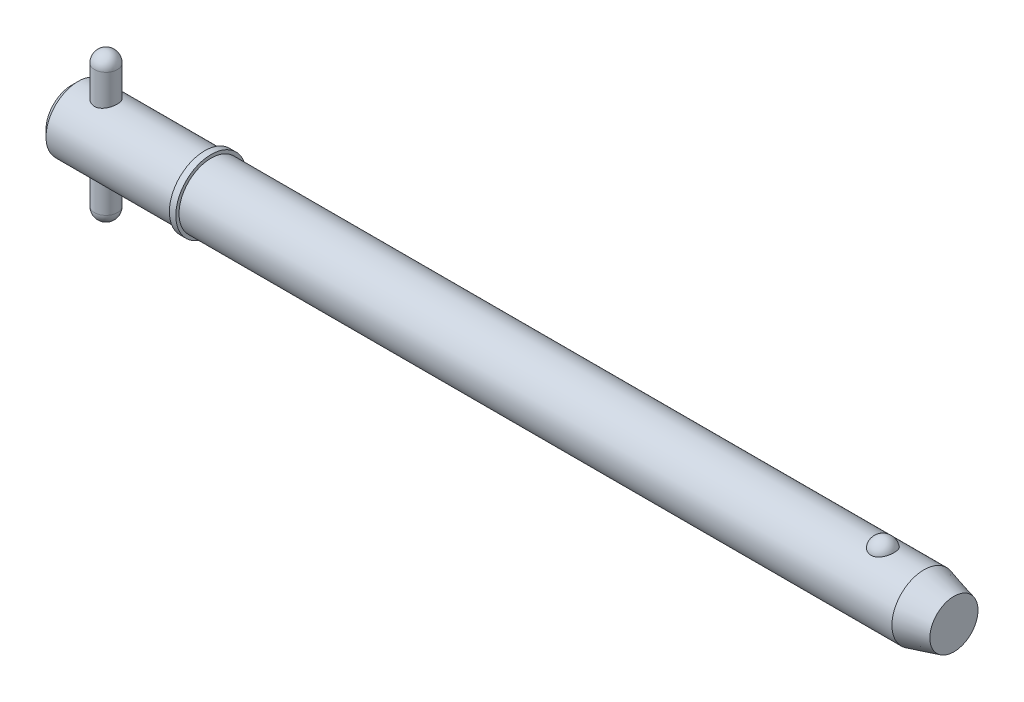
ISO-10303-21;
HEADER;
FILE_DESCRIPTION(('STEP AP214'),'2;1');
FILE_NAME('part.step','',(''),(''),'','','');
FILE_SCHEMA(('AUTOMOTIVE_DESIGN { 1 0 10303 214 1 1 1 1 }'));
ENDSEC;
DATA;
#1=APPLICATION_CONTEXT('core data for automotive mechanical design processes');
#2=APPLICATION_PROTOCOL_DEFINITION('international standard','automotive_design',2000,#1);
#3=PRODUCT_CONTEXT('',#1,'mechanical');
#4=PRODUCT('Part','Part','',(#3));
#5=PRODUCT_RELATED_PRODUCT_CATEGORY('part','',(#4));
#6=PRODUCT_DEFINITION_FORMATION('','',#4);
#7=PRODUCT_DEFINITION_CONTEXT('part definition',#1,'design');
#8=PRODUCT_DEFINITION('design','',#6,#7);
#9=PRODUCT_DEFINITION_SHAPE('','',#8);
#10=(LENGTH_UNIT() NAMED_UNIT(*) SI_UNIT(.MILLI.,.METRE.));
#11=(NAMED_UNIT(*) PLANE_ANGLE_UNIT() SI_UNIT($,.RADIAN.));
#12=(NAMED_UNIT(*) SI_UNIT($,.STERADIAN.) SOLID_ANGLE_UNIT());
#13=UNCERTAINTY_MEASURE_WITH_UNIT(LENGTH_MEASURE(1.E-05),#10,'distance_accuracy_value','');
#14=(GEOMETRIC_REPRESENTATION_CONTEXT(3) GLOBAL_UNCERTAINTY_ASSIGNED_CONTEXT((#13)) GLOBAL_UNIT_ASSIGNED_CONTEXT((#10,
#11,#12)) REPRESENTATION_CONTEXT('',''));
#15=CARTESIAN_POINT('',(0.,0.,0.));
#16=DIRECTION('',(0.,0.,1.));
#17=DIRECTION('',(1.,0.,0.));
#18=AXIS2_PLACEMENT_3D('',#15,#16,#17);
#19=CARTESIAN_POINT('',(5.94,12.7,0.));
#20=DIRECTION('',(0.,-1.,0.));
#21=DIRECTION('',(0.,0.,-1.));
#22=AXIS2_PLACEMENT_3D('',#19,#20,#21);
#23=CYLINDRICAL_SURFACE('',#22,1.98);
#24=CARTESIAN_POINT('',(5.94,-10.72,0.));
#25=DIRECTION('',(0.,-1.,0.));
#26=DIRECTION('',(0.,0.,-1.));
#27=AXIS2_PLACEMENT_3D('',#24,#25,#26);
#28=CIRCLE('',#27,1.98);
#29=CARTESIAN_POINT('',(5.94,-10.72,-1.98));
#30=VERTEX_POINT('',#29);
#31=EDGE_CURVE('P0_E10',#30,#30,#28,.F.);
#32=ORIENTED_EDGE('',*,*,#31,.T.);
#33=EDGE_LOOP('',(#32));
#34=FACE_BOUND('',#33,.T.);
#35=CARTESIAN_POINT('',(5.94,10.72,0.));
#36=DIRECTION('',(0.,-1.,0.));
#37=DIRECTION('',(0.,0.,-1.));
#38=AXIS2_PLACEMENT_3D('',#35,#36,#37);
#39=CIRCLE('',#38,1.98);
#40=CARTESIAN_POINT('',(5.94,10.72,-1.98));
#41=VERTEX_POINT('',#40);
#42=EDGE_CURVE('P0_E21',#41,#41,#39,.T.);
#43=ORIENTED_EDGE('',*,*,#42,.T.);
#44=EDGE_LOOP('',(#43));
#45=FACE_BOUND('',#44,.T.);
#46=ADVANCED_FACE('P0_F14',(#34,#45),#23,.T.);
#47=CARTESIAN_POINT('',(5.94,-10.72,0.));
#48=DIRECTION('',(0.,0.,1.));
#49=DIRECTION('',(1.,0.,0.));
#50=AXIS2_PLACEMENT_3D('',#47,#48,#49);
#51=SPHERICAL_SURFACE('',#50,1.98);
#52=CARTESIAN_POINT('',(5.94,-10.72,0.));
#53=DIRECTION('',(0.,-1.,0.));
#54=DIRECTION('',(0.,0.,-1.));
#55=AXIS2_PLACEMENT_3D('',#52,#53,#54);
#56=SPHERICAL_SURFACE('',#55,1.98);
#57=ORIENTED_EDGE('',*,*,#31,.F.);
#58=EDGE_LOOP('',(#57));
#59=FACE_BOUND('',#58,.T.);
#60=ADVANCED_FACE('P0_F29',(#59),#56,.T.);
#61=CARTESIAN_POINT('',(5.94,10.72,0.));
#62=DIRECTION('',(0.,0.,1.));
#63=DIRECTION('',(1.,0.,0.));
#64=AXIS2_PLACEMENT_3D('',#61,#62,#63);
#65=SPHERICAL_SURFACE('',#64,1.98);
#66=CARTESIAN_POINT('',(5.94,10.72,0.));
#67=DIRECTION('',(0.,-1.,0.));
#68=DIRECTION('',(0.,0.,-1.));
#69=AXIS2_PLACEMENT_3D('',#66,#67,#68);
#70=SPHERICAL_SURFACE('',#69,1.98);
#71=ORIENTED_EDGE('',*,*,#42,.F.);
#72=EDGE_LOOP('',(#71));
#73=FACE_BOUND('',#72,.T.);
#74=ADVANCED_FACE('P0_F16',(#73),#70,.T.);
#75=CLOSED_SHELL('',(#46,#60,#74));
#76=MANIFOLD_SOLID_BREP('P0_B1',#75);
#77=CARTESIAN_POINT('',(0.,0.,0.));
#78=DIRECTION('',(1.,0.,0.));
#79=DIRECTION('',(0.,0.,-1.));
#80=AXIS2_PLACEMENT_3D('',#77,#78,#79);
#81=CYLINDRICAL_SURFACE('',#80,5.555);
#82=CARTESIAN_POINT('',(147.517114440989,0.,0.));
#83=DIRECTION('',(1.,0.,0.));
#84=DIRECTION('',(0.,0.,-1.));
#85=AXIS2_PLACEMENT_3D('',#82,#83,#84);
#86=CIRCLE('',#85,5.555);
#87=CARTESIAN_POINT('',(147.517114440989,0.,-5.555));
#88=VERTEX_POINT('',#87);
#89=EDGE_CURVE('P1_E81',#88,#88,#86,.T.);
#90=ORIENTED_EDGE('',*,*,#89,.F.);
#91=EDGE_LOOP('',(#90));
#92=FACE_BOUND('',#91,.T.);
#93=CARTESIAN_POINT('',(24.13,0.,0.));
#94=DIRECTION('',(1.,0.,0.));
#95=DIRECTION('',(0.,0.,-1.));
#96=AXIS2_PLACEMENT_3D('',#93,#94,#95);
#97=CIRCLE('',#96,5.555);
#98=CARTESIAN_POINT('',(24.13,0.,-5.555));
#99=VERTEX_POINT('',#98);
#100=EDGE_CURVE('P1_E85',#99,#99,#97,.T.);
#101=ORIENTED_EDGE('',*,*,#100,.T.);
#102=EDGE_LOOP('',(#101));
#103=FACE_BOUND('',#102,.T.);
#104=CARTESIAN_POINT('',(140.398626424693,5.16741224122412,2.03859650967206));
#105=CARTESIAN_POINT('',(140.292949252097,5.16740893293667,2.03859990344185));
#106=CARTESIAN_POINT('',(140.18729894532,5.17079470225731,2.03008306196));
#107=CARTESIAN_POINT('',(139.979141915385,5.18392795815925,1.99630721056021));
#108=CARTESIAN_POINT('',(139.876634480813,5.19367399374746,1.97105201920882));
#109=CARTESIAN_POINT('',(139.677771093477,5.21839168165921,1.9046399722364));
#110=CARTESIAN_POINT('',(139.581406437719,5.23335573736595,1.8635062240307));
#111=CARTESIAN_POINT('',(139.397080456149,5.26688076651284,1.76652592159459));
#112=CARTESIAN_POINT('',(139.309120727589,5.28544242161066,1.71067657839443));
#113=CARTESIAN_POINT('',(139.141265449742,5.32479845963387,1.58399959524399));
#114=CARTESIAN_POINT('',(139.06166564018,5.34564089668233,1.51279545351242));
#115=CARTESIAN_POINT('',(138.91512901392,5.38697258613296,1.35828584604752));
#116=CARTESIAN_POINT('',(138.848194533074,5.40746177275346,1.27497815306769));
#117=CARTESIAN_POINT('',(138.72561039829,5.44694508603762,1.0944029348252));
#118=CARTESIAN_POINT('',(138.670598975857,5.46583143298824,0.996677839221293));
#119=CARTESIAN_POINT('',(138.576937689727,5.49908030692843,0.792961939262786));
#120=CARTESIAN_POINT('',(138.538289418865,5.513442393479,0.686970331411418));
#121=CARTESIAN_POINT('',(138.477680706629,5.53635851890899,0.468019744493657));
#122=CARTESIAN_POINT('',(138.455972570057,5.54482455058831,0.354981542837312));
#123=CARTESIAN_POINT('',(138.430636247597,5.55473324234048,0.12659586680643));
#124=CARTESIAN_POINT('',(138.427007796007,5.55617600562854,0.0112484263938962));
#125=CARTESIAN_POINT('',(138.437881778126,5.55189984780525,-0.218011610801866));
#126=CARTESIAN_POINT('',(138.452315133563,5.54620821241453,-0.331928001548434));
#127=CARTESIAN_POINT('',(138.498903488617,5.52828920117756,-0.555544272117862));
#128=CARTESIAN_POINT('',(138.531058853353,5.5160616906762,-0.665244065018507));
#129=CARTESIAN_POINT('',(138.612488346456,5.48630779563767,-0.877469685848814));
#130=CARTESIAN_POINT('',(138.661781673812,5.4687754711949,-0.979987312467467));
#131=CARTESIAN_POINT('',(138.776478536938,5.43024700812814,-1.17486975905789));
#132=CARTESIAN_POINT('',(138.841883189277,5.4092506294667,-1.26723387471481));
#133=CARTESIAN_POINT('',(138.987571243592,5.36600927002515,-1.4394013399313));
#134=CARTESIAN_POINT('',(139.067885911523,5.34376173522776,-1.51917763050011));
#135=CARTESIAN_POINT('',(139.241452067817,5.30057971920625,-1.66360338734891));
#136=CARTESIAN_POINT('',(139.334702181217,5.27964509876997,-1.72825445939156));
#137=CARTESIAN_POINT('',(139.529393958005,5.24205250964,-1.83909478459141));
#138=CARTESIAN_POINT('',(139.630590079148,5.22530519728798,-1.88568407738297));
#139=CARTESIAN_POINT('',(139.840155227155,5.1975091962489,-1.96100802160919));
#140=CARTESIAN_POINT('',(139.948521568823,5.1864583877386,-1.98974931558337));
#141=CARTESIAN_POINT('',(140.163498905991,5.17184410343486,-2.02742262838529));
#142=CARTESIAN_POINT('',(140.269925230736,5.1679328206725,-2.03727608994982));
#143=CARTESIAN_POINT('',(140.482992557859,5.16698995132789,-2.03966777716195));
#144=CARTESIAN_POINT('',(140.589633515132,5.16995704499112,-2.0322093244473));
#145=CARTESIAN_POINT('',(140.796773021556,5.18222383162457,-2.00071170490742));
#146=CARTESIAN_POINT('',(140.897359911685,5.19133213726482,-1.97717337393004));
#147=CARTESIAN_POINT('',(141.093014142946,5.21467637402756,-1.91475248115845));
#148=CARTESIAN_POINT('',(141.188081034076,5.22891272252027,-1.87586867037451));
#149=CARTESIAN_POINT('',(141.372371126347,5.26137066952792,-1.78282713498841));
#150=CARTESIAN_POINT('',(141.461419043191,5.27967329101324,-1.72835124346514));
#151=CARTESIAN_POINT('',(141.629288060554,5.3181741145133,-1.60597483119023));
#152=CARTESIAN_POINT('',(141.708106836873,5.33837274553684,-1.5380712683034));
#153=CARTESIAN_POINT('',(141.857515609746,5.37968287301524,-1.38688970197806));
#154=CARTESIAN_POINT('',(141.927505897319,5.40079011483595,-1.30301744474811));
#155=CARTESIAN_POINT('',(142.053012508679,5.44074401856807,-1.12458170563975));
#156=CARTESIAN_POINT('',(142.108526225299,5.45959027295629,-1.03001630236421));
#157=CARTESIAN_POINT('',(142.205550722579,5.49369849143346,-0.829439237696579));
#158=CARTESIAN_POINT('',(142.246548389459,5.50882422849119,-0.723155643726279));
#159=CARTESIAN_POINT('',(142.311125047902,5.53310911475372,-0.504772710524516));
#160=CARTESIAN_POINT('',(142.334703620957,5.54226812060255,-0.392673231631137));
#161=CARTESIAN_POINT('',(142.364013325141,5.55370358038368,-0.165459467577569));
#162=CARTESIAN_POINT('',(142.369688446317,5.55595843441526,-0.0503368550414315));
#163=CARTESIAN_POINT('',(142.362916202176,5.55329317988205,0.179288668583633));
#164=CARTESIAN_POINT('',(142.350469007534,5.54837313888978,0.293791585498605));
#165=CARTESIAN_POINT('',(142.307779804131,5.53189037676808,0.51852641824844));
#166=CARTESIAN_POINT('',(142.277598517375,5.5203503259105,0.62877154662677));
#167=CARTESIAN_POINT('',(142.200096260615,5.49182453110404,0.842318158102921));
#168=CARTESIAN_POINT('',(142.152774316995,5.47483847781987,0.94561924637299));
#169=CARTESIAN_POINT('',(142.041720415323,5.43710633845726,1.14281571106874));
#170=CARTESIAN_POINT('',(141.977921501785,5.41634501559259,1.23667048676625));
#171=CARTESIAN_POINT('',(141.835357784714,5.37334572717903,1.4118524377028));
#172=CARTESIAN_POINT('',(141.75659323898,5.35110778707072,1.49317982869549));
#173=CARTESIAN_POINT('',(141.586423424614,5.30779474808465,1.64049162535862));
#174=CARTESIAN_POINT('',(141.49510026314,5.2867132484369,1.70656877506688));
#175=CARTESIAN_POINT('',(141.301739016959,5.2480485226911,1.82201372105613));
#176=CARTESIAN_POINT('',(141.199700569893,5.23046541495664,1.87138095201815));
#177=CARTESIAN_POINT('',(140.983618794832,5.20042692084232,1.95335298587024));
#178=CARTESIAN_POINT('',(140.869260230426,5.18820192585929,1.98521734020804));
#179=CARTESIAN_POINT('',(140.636130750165,5.17169804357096,2.02783294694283));
#180=CARTESIAN_POINT('',(140.517361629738,5.16741595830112,2.03859269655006));
#181=CARTESIAN_POINT('',(140.398626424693,5.16741224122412,2.03859650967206));
#182=B_SPLINE_CURVE_WITH_KNOTS('',3,(#104,#105,#106,#107,#108,#109,#110,#111,#112,#113,#114,
#115,#116,#117,#118,#119,#120,#121,#122,#123,#124,#125,#126,#127,#128,#129,#130,#131,#132,#133,
#134,#135,#136,#137,#138,#139,#140,#141,#142,#143,#144,#145,#146,#147,#148,#149,#150,#151,#152,
#153,#154,#155,#156,#157,#158,#159,#160,#161,#162,#163,#164,#165,#166,#167,#168,#169,#170,#171,
#172,#173,#174,#175,#176,#177,#178,#179,#180,#181),.UNSPECIFIED.,.T.,.F.,(4,2,2,2,2,2,2,2,2,2,2,
2,2,2,2,2,2,2,2,2,2,2,2,2,2,2,2,2,2,2,2,2,2,2,2,2,2,2,4),(0.,0.316595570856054,
0.633118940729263,0.94918341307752,1.26530783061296,1.59030762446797,1.91536729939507,
2.25495824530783,2.59458224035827,2.93917283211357,3.28375835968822,3.62703002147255,
3.97030875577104,4.31397329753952,4.657661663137,5.00207904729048,5.34645984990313,
5.68270547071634,6.01882587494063,6.33808403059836,6.65728093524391,6.9669637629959,
7.27667180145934,7.59321535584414,7.90983070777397,8.24210387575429,8.57443684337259,
8.91755896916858,9.26068933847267,9.60489211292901,9.94909164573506,10.2921194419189,
10.6351667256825,10.9796305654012,11.3240884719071,11.6663928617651,12.0087088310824,
12.3645679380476,12.7202837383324),.UNSPECIFIED.);
#183=CARTESIAN_POINT('',(140.398626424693,5.16741224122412,2.03859650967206));
#184=VERTEX_POINT('',#183);
#185=EDGE_CURVE('P1_E35',#184,#184,#182,.T.);
#186=ORIENTED_EDGE('',*,*,#185,.T.);
#187=EDGE_LOOP('',(#186));
#188=FACE_BOUND('',#187,.T.);
#189=ADVANCED_FACE('P1_F13',(#92,#103,#188),#81,.T.);
#190=CARTESIAN_POINT('',(0.,0.,0.));
#191=DIRECTION('',(-1.,0.,0.));
#192=DIRECTION('',(0.,0.,1.));
#193=AXIS2_PLACEMENT_3D('',#190,#191,#192);
#194=PLANE('',#193);
#195=CARTESIAN_POINT('',(0.,0.,0.));
#196=DIRECTION('',(1.,0.,0.));
#197=DIRECTION('',(0.,0.,-1.));
#198=AXIS2_PLACEMENT_3D('',#195,#196,#197);
#199=CIRCLE('',#198,4.444);
#200=CARTESIAN_POINT('',(0.,0.,-4.444));
#201=VERTEX_POINT('',#200);
#202=EDGE_CURVE('P1_E9',#201,#201,#199,.T.);
#203=ORIENTED_EDGE('',*,*,#202,.F.);
#204=EDGE_LOOP('',(#203));
#205=FACE_BOUND('',#204,.T.);
#206=ADVANCED_FACE('P1_F15',(#205),#194,.T.);
#207=CARTESIAN_POINT('',(1.111,0.,0.));
#208=DIRECTION('',(1.,0.,0.));
#209=DIRECTION('',(0.,0.,-1.));
#210=AXIS2_PLACEMENT_3D('',#207,#208,#209);
#211=CONICAL_SURFACE('',#210,5.555,0.78539816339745);
#212=ORIENTED_EDGE('',*,*,#202,.T.);
#213=EDGE_LOOP('',(#212));
#214=FACE_BOUND('',#213,.T.);
#215=CARTESIAN_POINT('',(1.111,0.,0.));
#216=DIRECTION('',(1.,0.,0.));
#217=DIRECTION('',(0.,0.,-1.));
#218=AXIS2_PLACEMENT_3D('',#215,#216,#217);
#219=CIRCLE('',#218,5.555);
#220=CARTESIAN_POINT('',(1.111,0.,-5.555));
#221=VERTEX_POINT('',#220);
#222=EDGE_CURVE('P1_E26',#221,#221,#219,.T.);
#223=ORIENTED_EDGE('',*,*,#222,.F.);
#224=EDGE_LOOP('',(#223));
#225=FACE_BOUND('',#224,.T.);
#226=ADVANCED_FACE('P1_F77',(#214,#225),#211,.T.);
#227=CARTESIAN_POINT('',(0.,0.,0.));
#228=DIRECTION('',(1.,0.,0.));
#229=DIRECTION('',(0.,0.,-1.));
#230=AXIS2_PLACEMENT_3D('',#227,#228,#229);
#231=CYLINDRICAL_SURFACE('',#230,5.555);
#232=CARTESIAN_POINT('',(5.94,-5.19014691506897,1.98));
#233=CARTESIAN_POINT('',(5.83264687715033,-5.19014494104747,1.98000226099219));
#234=CARTESIAN_POINT('',(5.7253094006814,-5.19351395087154,1.97123988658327));
#235=CARTESIAN_POINT('',(5.51384517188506,-5.20654291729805,1.93656219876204));
#236=CARTESIAN_POINT('',(5.40971858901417,-5.21620320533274,1.91064598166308));
#237=CARTESIAN_POINT('',(5.20778082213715,-5.24058443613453,1.84271148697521));
#238=CARTESIAN_POINT('',(5.10995634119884,-5.25529427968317,1.80072850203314));
#239=CARTESIAN_POINT('',(4.92270352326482,-5.28810012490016,1.70197537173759));
#240=CARTESIAN_POINT('',(4.83327743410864,-5.3061970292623,1.64520128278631));
#241=CARTESIAN_POINT('',(4.66135184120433,-5.34464714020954,1.51575187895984));
#242=CARTESIAN_POINT('',(4.57928277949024,-5.36506222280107,1.44252311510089));
#243=CARTESIAN_POINT('',(4.42829115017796,-5.40532920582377,1.28342047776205));
#244=CARTESIAN_POINT('',(4.35937105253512,-5.42518099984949,1.19754423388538));
#245=CARTESIAN_POINT('',(4.23461605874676,-5.46281133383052,1.01237205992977));
#246=CARTESIAN_POINT('',(4.17924129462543,-5.48050875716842,0.912748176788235));
#247=CARTESIAN_POINT('',(4.0862117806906,-5.51109938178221,0.70485824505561));
#248=CARTESIAN_POINT('',(4.0485515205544,-5.52399407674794,0.596594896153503));
#249=CARTESIAN_POINT('',(3.99350662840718,-5.54308759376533,0.379019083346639));
#250=CARTESIAN_POINT('',(3.97538263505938,-5.54952987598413,0.269915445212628));
#251=CARTESIAN_POINT('',(3.95756405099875,-5.55586205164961,0.0500378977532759));
#252=CARTESIAN_POINT('',(3.95786404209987,-5.55575387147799,-0.060735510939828));
#253=CARTESIAN_POINT('',(3.97643665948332,-5.54915684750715,-0.275539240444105));
#254=CARTESIAN_POINT('',(3.99390415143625,-5.54295384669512,-0.379649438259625));
#255=CARTESIAN_POINT('',(4.0449721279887,-5.52523170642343,-0.583350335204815));
#256=CARTESIAN_POINT('',(4.07857373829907,-5.51371219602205,-0.682940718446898));
#257=CARTESIAN_POINT('',(4.16137312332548,-5.4863099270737,-0.876423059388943));
#258=CARTESIAN_POINT('',(4.2107826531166,-5.47036834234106,-0.970215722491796));
#259=CARTESIAN_POINT('',(4.32361427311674,-5.43575653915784,-1.1484017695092));
#260=CARTESIAN_POINT('',(4.38704062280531,-5.41708549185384,-1.23279228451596));
#261=CARTESIAN_POINT('',(4.53006791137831,-5.37778429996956,-1.39454579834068));
#262=CARTESIAN_POINT('',(4.61035105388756,-5.35710277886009,-1.4712940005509));
#263=CARTESIAN_POINT('',(4.78279835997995,-5.31692766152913,-1.6104545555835));
#264=CARTESIAN_POINT('',(4.874964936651,-5.29743430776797,-1.67286398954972));
#265=CARTESIAN_POINT('',(5.07076688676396,-5.26153775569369,-1.78259698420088));
#266=CARTESIAN_POINT('',(5.17458163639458,-5.24519780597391,-1.8296227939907));
#267=CARTESIAN_POINT('',(5.38938990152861,-5.21818744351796,-1.90530278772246));
#268=CARTESIAN_POINT('',(5.50037985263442,-5.20751423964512,-1.93396601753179));
#269=CARTESIAN_POINT('',(5.72036376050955,-5.19369176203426,-1.97077654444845));
#270=CARTESIAN_POINT('',(5.82917370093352,-5.19018851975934,-1.97989015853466));
#271=CARTESIAN_POINT('',(6.04680100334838,-5.19010609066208,-1.98010779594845));
#272=CARTESIAN_POINT('',(6.15561835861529,-5.19352540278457,-1.97121572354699));
#273=CARTESIAN_POINT('',(6.36548036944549,-5.20654623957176,-1.93654727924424));
#274=CARTESIAN_POINT('',(6.46666051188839,-5.21588705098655,-1.91148218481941));
#275=CARTESIAN_POINT('',(6.66334537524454,-5.23939939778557,-1.84605494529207));
#276=CARTESIAN_POINT('',(6.75884899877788,-5.25357186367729,-1.8056898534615));
#277=CARTESIAN_POINT('',(6.94517989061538,-5.28576258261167,-1.70921153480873));
#278=CARTESIAN_POINT('',(7.03572661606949,-5.30389804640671,-1.65259670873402));
#279=CARTESIAN_POINT('',(7.20638087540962,-5.34176077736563,-1.52577523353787));
#280=CARTESIAN_POINT('',(7.28648490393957,-5.36148857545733,-1.45556404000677));
#281=CARTESIAN_POINT('',(7.43864697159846,-5.40165494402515,-1.2988614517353));
#282=CARTESIAN_POINT('',(7.50999887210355,-5.42207106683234,-1.21167640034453));
#283=CARTESIAN_POINT('',(7.63712639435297,-5.46023601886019,-1.026066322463));
#284=CARTESIAN_POINT('',(7.69290228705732,-5.47798489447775,-0.927641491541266));
#285=CARTESIAN_POINT('',(7.78684673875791,-5.50876590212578,-0.722633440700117));
#286=CARTESIAN_POINT('',(7.82510508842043,-5.52182201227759,-0.616095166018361));
#287=CARTESIAN_POINT('',(7.88297051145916,-5.54184206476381,-0.397530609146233));
#288=CARTESIAN_POINT('',(7.90258540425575,-5.5488085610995,-0.285506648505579));
#289=CARTESIAN_POINT('',(7.9218262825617,-5.55564472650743,-0.065566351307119));
#290=CARTESIAN_POINT('',(7.92245987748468,-5.55587212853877,0.0422515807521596));
#291=CARTESIAN_POINT('',(7.90626329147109,-5.55011340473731,0.256387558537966));
#292=CARTESIAN_POINT('',(7.88943488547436,-5.54412791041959,0.362705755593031));
#293=CARTESIAN_POINT('',(7.83948457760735,-5.52676548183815,0.568649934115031));
#294=CARTESIAN_POINT('',(7.8067003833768,-5.51550046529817,0.668367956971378));
#295=CARTESIAN_POINT('',(7.72609369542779,-5.48874437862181,0.860911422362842));
#296=CARTESIAN_POINT('',(7.67826838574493,-5.47325251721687,0.953735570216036));
#297=CARTESIAN_POINT('',(7.56675024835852,-5.43884382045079,1.13391068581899));
#298=CARTESIAN_POINT('',(7.50249968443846,-5.41981485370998,1.22089468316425));
#299=CARTESIAN_POINT('',(7.36086495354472,-5.38069275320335,1.38316665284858));
#300=CARTESIAN_POINT('',(7.28347630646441,-5.36059925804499,1.45845061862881));
#301=CARTESIAN_POINT('',(7.11347587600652,-5.32048380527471,1.59876646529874));
#302=CARTESIAN_POINT('',(7.02032386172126,-5.30050854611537,1.66315951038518));
#303=CARTESIAN_POINT('',(6.82388804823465,-5.26398994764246,1.77536801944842));
#304=CARTESIAN_POINT('',(6.7206049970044,-5.24744635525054,1.82318470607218));
#305=CARTESIAN_POINT('',(6.50639706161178,-5.21987969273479,1.90068230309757));
#306=CARTESIAN_POINT('',(6.3954529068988,-5.20887116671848,1.93031547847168));
#307=CARTESIAN_POINT('',(6.16966522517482,-5.19400760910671,1.96996824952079));
#308=CARTESIAN_POINT('',(6.05482366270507,-5.19014902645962,1.97999758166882));
#309=CARTESIAN_POINT('',(5.94,-5.19014691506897,1.98));
#310=B_SPLINE_CURVE_WITH_KNOTS('',3,(#232,#233,#234,#235,#236,#237,#238,#239,#240,#241,#242,
#243,#244,#245,#246,#247,#248,#249,#250,#251,#252,#253,#254,#255,#256,#257,#258,#259,#260,#261,
#262,#263,#264,#265,#266,#267,#268,#269,#270,#271,#272,#273,#274,#275,#276,#277,#278,#279,#280,
#281,#282,#283,#284,#285,#286,#287,#288,#289,#290,#291,#292,#293,#294,#295,#296,#297,#298,#299,
#300,#301,#302,#303,#304,#305,#306,#307,#308,#309),.UNSPECIFIED.,.T.,.F.,(4,2,2,2,2,2,2,2,2,2,2,
2,2,2,2,2,2,2,2,2,2,2,2,2,2,2,2,2,2,2,2,2,2,2,2,2,2,2,4),(0.,0.321632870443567,
0.643282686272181,0.964229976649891,1.28526292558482,1.61937087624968,1.9535415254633,
2.29784481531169,2.64204093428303,2.97269632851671,3.30325448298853,3.61901541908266,
3.93479838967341,4.25500220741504,4.57530346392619,4.91268648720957,5.25013812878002,
5.59378026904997,5.93725299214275,6.26331481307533,6.58930593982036,6.90185604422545,
7.21446637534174,7.53801472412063,7.86167140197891,8.20353561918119,8.54539388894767,
8.88547970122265,9.22542281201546,9.54728637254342,9.86911722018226,10.1844146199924,
10.4997710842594,10.827730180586,11.1558013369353,11.499115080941,11.8424034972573,
12.1865892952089,12.5306041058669),.UNSPECIFIED.);
#311=CARTESIAN_POINT('',(5.94,-5.19014691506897,1.98));
#312=VERTEX_POINT('',#311);
#313=EDGE_CURVE('P1_E17',#312,#312,#310,.T.);
#314=ORIENTED_EDGE('',*,*,#313,.F.);
#315=EDGE_LOOP('',(#314));
#316=FACE_BOUND('',#315,.T.);
#317=CARTESIAN_POINT('',(5.94,5.19014691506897,1.98));
#318=CARTESIAN_POINT('',(6.04735312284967,5.19014494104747,1.98000226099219));
#319=CARTESIAN_POINT('',(6.1546905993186,5.19351395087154,1.97123988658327));
#320=CARTESIAN_POINT('',(6.36615482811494,5.20654291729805,1.93656219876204));
#321=CARTESIAN_POINT('',(6.47028141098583,5.21620320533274,1.91064598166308));
#322=CARTESIAN_POINT('',(6.67221917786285,5.24058443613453,1.84271148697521));
#323=CARTESIAN_POINT('',(6.77004365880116,5.25529427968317,1.80072850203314));
#324=CARTESIAN_POINT('',(6.95729647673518,5.28810012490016,1.70197537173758));
#325=CARTESIAN_POINT('',(7.04672256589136,5.3061970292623,1.64520128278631));
#326=CARTESIAN_POINT('',(7.21864815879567,5.34464714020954,1.51575187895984));
#327=CARTESIAN_POINT('',(7.30071722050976,5.36506222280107,1.44252311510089));
#328=CARTESIAN_POINT('',(7.45170884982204,5.40532920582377,1.28342047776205));
#329=CARTESIAN_POINT('',(7.52062894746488,5.42518099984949,1.19754423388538));
#330=CARTESIAN_POINT('',(7.64538394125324,5.46281133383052,1.01237205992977));
#331=CARTESIAN_POINT('',(7.70075870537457,5.48050875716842,0.912748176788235));
#332=CARTESIAN_POINT('',(7.7937882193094,5.51109938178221,0.704858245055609));
#333=CARTESIAN_POINT('',(7.8314484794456,5.52399407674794,0.596594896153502));
#334=CARTESIAN_POINT('',(7.88649337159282,5.54308759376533,0.379019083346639));
#335=CARTESIAN_POINT('',(7.90461736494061,5.54952987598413,0.269915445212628));
#336=CARTESIAN_POINT('',(7.92243594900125,5.55586205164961,0.0500378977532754));
#337=CARTESIAN_POINT('',(7.92213595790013,5.55575387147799,-0.0607355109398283));
#338=CARTESIAN_POINT('',(7.90356334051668,5.54915684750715,-0.275539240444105));
#339=CARTESIAN_POINT('',(7.88609584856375,5.54295384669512,-0.379649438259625));
#340=CARTESIAN_POINT('',(7.8350278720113,5.52523170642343,-0.583350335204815));
#341=CARTESIAN_POINT('',(7.80142626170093,5.51371219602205,-0.682940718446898));
#342=CARTESIAN_POINT('',(7.71862687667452,5.4863099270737,-0.876423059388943));
#343=CARTESIAN_POINT('',(7.6692173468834,5.47036834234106,-0.970215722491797));
#344=CARTESIAN_POINT('',(7.55638572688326,5.43575653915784,-1.1484017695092));
#345=CARTESIAN_POINT('',(7.49295937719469,5.41708549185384,-1.23279228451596));
#346=CARTESIAN_POINT('',(7.34993208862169,5.37778429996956,-1.39454579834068));
#347=CARTESIAN_POINT('',(7.26964894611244,5.35710277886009,-1.4712940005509));
#348=CARTESIAN_POINT('',(7.09720164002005,5.31692766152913,-1.6104545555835));
#349=CARTESIAN_POINT('',(7.00503506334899,5.29743430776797,-1.67286398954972));
#350=CARTESIAN_POINT('',(6.80923311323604,5.26153775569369,-1.78259698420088));
#351=CARTESIAN_POINT('',(6.70541836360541,5.24519780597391,-1.8296227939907));
#352=CARTESIAN_POINT('',(6.49061009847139,5.21818744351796,-1.90530278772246));
#353=CARTESIAN_POINT('',(6.37962014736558,5.20751423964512,-1.93396601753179));
#354=CARTESIAN_POINT('',(6.15963623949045,5.19369176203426,-1.97077654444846));
#355=CARTESIAN_POINT('',(6.05082629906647,5.19018851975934,-1.97989015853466));
#356=CARTESIAN_POINT('',(5.83319899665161,5.19010609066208,-1.98010779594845));
#357=CARTESIAN_POINT('',(5.7243816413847,5.19352540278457,-1.97121572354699));
#358=CARTESIAN_POINT('',(5.5145196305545,5.20654623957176,-1.93654727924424));
#359=CARTESIAN_POINT('',(5.4133394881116,5.21588705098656,-1.91148218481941));
#360=CARTESIAN_POINT('',(5.21665462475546,5.23939939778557,-1.84605494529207));
#361=CARTESIAN_POINT('',(5.12115100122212,5.25357186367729,-1.8056898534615));
#362=CARTESIAN_POINT('',(4.93482010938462,5.28576258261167,-1.70921153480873));
#363=CARTESIAN_POINT('',(4.84427338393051,5.30389804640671,-1.65259670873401));
#364=CARTESIAN_POINT('',(4.67361912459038,5.34176077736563,-1.52577523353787));
#365=CARTESIAN_POINT('',(4.59351509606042,5.36148857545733,-1.45556404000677));
#366=CARTESIAN_POINT('',(4.44135302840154,5.40165494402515,-1.2988614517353));
#367=CARTESIAN_POINT('',(4.37000112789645,5.42207106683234,-1.21167640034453));
#368=CARTESIAN_POINT('',(4.24287360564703,5.46023601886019,-1.026066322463));
#369=CARTESIAN_POINT('',(4.18709771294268,5.47798489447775,-0.927641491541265));
#370=CARTESIAN_POINT('',(4.09315326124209,5.50876590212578,-0.722633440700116));
#371=CARTESIAN_POINT('',(4.05489491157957,5.52182201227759,-0.61609516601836));
#372=CARTESIAN_POINT('',(3.99702948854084,5.54184206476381,-0.397530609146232));
#373=CARTESIAN_POINT('',(3.97741459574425,5.5488085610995,-0.285506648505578));
#374=CARTESIAN_POINT('',(3.9581737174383,5.55564472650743,-0.0655663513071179));
#375=CARTESIAN_POINT('',(3.95754012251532,5.55587212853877,0.0422515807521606));
#376=CARTESIAN_POINT('',(3.97373670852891,5.55011340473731,0.256387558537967));
#377=CARTESIAN_POINT('',(3.99056511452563,5.54412791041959,0.362705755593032));
#378=CARTESIAN_POINT('',(4.04051542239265,5.52676548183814,0.568649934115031));
#379=CARTESIAN_POINT('',(4.07329961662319,5.51550046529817,0.668367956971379));
#380=CARTESIAN_POINT('',(4.15390630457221,5.48874437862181,0.860911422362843));
#381=CARTESIAN_POINT('',(4.20173161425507,5.47325251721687,0.953735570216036));
#382=CARTESIAN_POINT('',(4.31324975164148,5.43884382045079,1.13391068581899));
#383=CARTESIAN_POINT('',(4.37750031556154,5.41981485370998,1.22089468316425));
#384=CARTESIAN_POINT('',(4.51913504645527,5.38069275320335,1.38316665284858));
#385=CARTESIAN_POINT('',(4.59652369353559,5.36059925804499,1.45845061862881));
#386=CARTESIAN_POINT('',(4.76652412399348,5.32048380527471,1.59876646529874));
#387=CARTESIAN_POINT('',(4.85967613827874,5.30050854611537,1.66315951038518));
#388=CARTESIAN_POINT('',(5.05611195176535,5.26398994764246,1.77536801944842));
#389=CARTESIAN_POINT('',(5.1593950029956,5.24744635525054,1.82318470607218));
#390=CARTESIAN_POINT('',(5.37360293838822,5.21987969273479,1.90068230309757));
#391=CARTESIAN_POINT('',(5.4845470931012,5.20887116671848,1.93031547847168));
#392=CARTESIAN_POINT('',(5.71033477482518,5.19400760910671,1.96996824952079));
#393=CARTESIAN_POINT('',(5.82517633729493,5.19014902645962,1.97999758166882));
#394=CARTESIAN_POINT('',(5.94,5.19014691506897,1.98));
#395=B_SPLINE_CURVE_WITH_KNOTS('',3,(#317,#318,#319,#320,#321,#322,#323,#324,#325,#326,#327,
#328,#329,#330,#331,#332,#333,#334,#335,#336,#337,#338,#339,#340,#341,#342,#343,#344,#345,#346,
#347,#348,#349,#350,#351,#352,#353,#354,#355,#356,#357,#358,#359,#360,#361,#362,#363,#364,#365,
#366,#367,#368,#369,#370,#371,#372,#373,#374,#375,#376,#377,#378,#379,#380,#381,#382,#383,#384,
#385,#386,#387,#388,#389,#390,#391,#392,#393,#394),.UNSPECIFIED.,.T.,.F.,(4,2,2,2,2,2,2,2,2,2,2,
2,2,2,2,2,2,2,2,2,2,2,2,2,2,2,2,2,2,2,2,2,2,2,2,2,2,2,4),(0.,0.321632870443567,
0.643282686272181,0.964229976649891,1.28526292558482,1.61937087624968,1.9535415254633,
2.29784481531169,2.64204093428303,2.97269632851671,3.30325448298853,3.61901541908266,
3.93479838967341,4.25500220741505,4.57530346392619,4.91268648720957,5.25013812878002,
5.59378026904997,5.93725299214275,6.26331481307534,6.58930593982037,6.90185604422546,
7.21446637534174,7.53801472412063,7.86167140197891,8.20353561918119,8.54539388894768,
8.88547970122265,9.22542281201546,9.54728637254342,9.86911722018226,10.1844146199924,
10.4997710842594,10.827730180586,11.1558013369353,11.499115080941,11.8424034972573,
12.1865892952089,12.5306041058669),.UNSPECIFIED.);
#396=CARTESIAN_POINT('',(5.94,5.19014691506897,1.98));
#397=VERTEX_POINT('',#396);
#398=EDGE_CURVE('P1_E43',#397,#397,#395,.T.);
#399=ORIENTED_EDGE('',*,*,#398,.F.);
#400=EDGE_LOOP('',(#399));
#401=FACE_BOUND('',#400,.T.);
#402=ORIENTED_EDGE('',*,*,#222,.T.);
#403=EDGE_LOOP('',(#402));
#404=FACE_BOUND('',#403,.T.);
#405=CARTESIAN_POINT('',(23.019,0.,0.));
#406=DIRECTION('',(1.,0.,0.));
#407=DIRECTION('',(0.,0.,-1.));
#408=AXIS2_PLACEMENT_3D('',#405,#406,#407);
#409=CIRCLE('',#408,5.555);
#410=CARTESIAN_POINT('',(23.019,0.,-5.555));
#411=VERTEX_POINT('',#410);
#412=EDGE_CURVE('P1_E31',#411,#411,#409,.T.);
#413=ORIENTED_EDGE('',*,*,#412,.F.);
#414=EDGE_LOOP('',(#413));
#415=FACE_BOUND('',#414,.T.);
#416=ADVANCED_FACE('P1_F103',(#316,#401,#404,#415),#231,.T.);
#417=CARTESIAN_POINT('',(23.019,5.555,0.));
#418=DIRECTION('',(-1.,0.,0.));
#419=DIRECTION('',(0.,0.,1.));
#420=AXIS2_PLACEMENT_3D('',#417,#418,#419);
#421=PLANE('',#420);
#422=ORIENTED_EDGE('',*,*,#412,.T.);
#423=EDGE_LOOP('',(#422));
#424=FACE_BOUND('',#423,.T.);
#425=CARTESIAN_POINT('',(23.019,0.,0.));
#426=DIRECTION('',(1.,0.,0.));
#427=DIRECTION('',(0.,0.,-1.));
#428=AXIS2_PLACEMENT_3D('',#425,#426,#427);
#429=CIRCLE('',#428,6.1105);
#430=CARTESIAN_POINT('',(23.019,0.,-6.1105));
#431=VERTEX_POINT('',#430);
#432=EDGE_CURVE('P1_E91',#431,#431,#429,.T.);
#433=ORIENTED_EDGE('',*,*,#432,.F.);
#434=EDGE_LOOP('',(#433));
#435=FACE_BOUND('',#434,.T.);
#436=ADVANCED_FACE('P1_F100',(#424,#435),#421,.T.);
#437=CARTESIAN_POINT('',(0.,0.,0.));
#438=DIRECTION('',(1.,0.,0.));
#439=DIRECTION('',(0.,0.,-1.));
#440=AXIS2_PLACEMENT_3D('',#437,#438,#439);
#441=CYLINDRICAL_SURFACE('',#440,6.1105);
#442=ORIENTED_EDGE('',*,*,#432,.T.);
#443=EDGE_LOOP('',(#442));
#444=FACE_BOUND('',#443,.T.);
#445=CARTESIAN_POINT('',(24.13,0.,0.));
#446=DIRECTION('',(1.,0.,0.));
#447=DIRECTION('',(0.,0.,-1.));
#448=AXIS2_PLACEMENT_3D('',#445,#446,#447);
#449=CIRCLE('',#448,6.1105);
#450=CARTESIAN_POINT('',(24.13,0.,-6.1105));
#451=VERTEX_POINT('',#450);
#452=EDGE_CURVE('P1_E88',#451,#451,#449,.T.);
#453=ORIENTED_EDGE('',*,*,#452,.F.);
#454=EDGE_LOOP('',(#453));
#455=FACE_BOUND('',#454,.T.);
#456=ADVANCED_FACE('P1_F68',(#444,#455),#441,.T.);
#457=CARTESIAN_POINT('',(24.13,6.1105,0.));
#458=DIRECTION('',(1.,0.,0.));
#459=DIRECTION('',(0.,0.,-1.));
#460=AXIS2_PLACEMENT_3D('',#457,#458,#459);
#461=PLANE('',#460);
#462=ORIENTED_EDGE('',*,*,#452,.T.);
#463=EDGE_LOOP('',(#462));
#464=FACE_BOUND('',#463,.T.);
#465=ORIENTED_EDGE('',*,*,#100,.F.);
#466=EDGE_LOOP('',(#465));
#467=FACE_BOUND('',#466,.T.);
#468=ADVANCED_FACE('P1_F62',(#464,#467),#461,.T.);
#469=CARTESIAN_POINT('',(152.7,0.,0.));
#470=DIRECTION('',(-1.,0.,0.));
#471=DIRECTION('',(0.,0.,1.));
#472=AXIS2_PLACEMENT_3D('',#469,#470,#471);
#473=CONICAL_SURFACE('',#472,4.16625000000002,0.261799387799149);
#474=ORIENTED_EDGE('',*,*,#89,.T.);
#475=EDGE_LOOP('',(#474));
#476=FACE_BOUND('',#475,.T.);
#477=CARTESIAN_POINT('',(152.7,0.,0.));
#478=DIRECTION('',(1.,0.,0.));
#479=DIRECTION('',(0.,0.,-1.));
#480=AXIS2_PLACEMENT_3D('',#477,#478,#479);
#481=CIRCLE('',#480,4.16625000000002);
#482=CARTESIAN_POINT('',(152.7,0.,-4.16625000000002));
#483=VERTEX_POINT('',#482);
#484=EDGE_CURVE('P1_E42',#483,#483,#481,.T.);
#485=ORIENTED_EDGE('',*,*,#484,.F.);
#486=EDGE_LOOP('',(#485));
#487=FACE_BOUND('',#486,.T.);
#488=ADVANCED_FACE('P1_F59',(#476,#487),#473,.T.);
#489=CARTESIAN_POINT('',(152.7,4.16625000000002,0.));
#490=DIRECTION('',(1.,0.,0.));
#491=DIRECTION('',(0.,0.,-1.));
#492=AXIS2_PLACEMENT_3D('',#489,#490,#491);
#493=PLANE('',#492);
#494=ORIENTED_EDGE('',*,*,#484,.T.);
#495=EDGE_LOOP('',(#494));
#496=FACE_BOUND('',#495,.T.);
#497=ADVANCED_FACE('P1_F55',(#496),#493,.T.);
#498=CARTESIAN_POINT('',(140.398626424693,4.9995,0.));
#499=DIRECTION('',(-1.,0.,0.));
#500=DIRECTION('',(0.,1.,0.));
#501=AXIS2_PLACEMENT_3D('',#498,#499,#500);
#502=SPHERICAL_SURFACE('',#501,2.04550000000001);
#503=ORIENTED_EDGE('',*,*,#185,.F.);
#504=EDGE_LOOP('',(#503));
#505=FACE_BOUND('',#504,.T.);
#506=ADVANCED_FACE('P1_F50',(#505),#502,.T.);
#507=CARTESIAN_POINT('',(5.94,-6.1105,0.));
#508=DIRECTION('',(0.,1.,0.));
#509=DIRECTION('',(0.,0.,1.));
#510=AXIS2_PLACEMENT_3D('',#507,#508,#509);
#511=CYLINDRICAL_SURFACE('',#510,1.98);
#512=ORIENTED_EDGE('',*,*,#313,.T.);
#513=EDGE_LOOP('',(#512));
#514=FACE_BOUND('',#513,.T.);
#515=ORIENTED_EDGE('',*,*,#398,.T.);
#516=EDGE_LOOP('',(#515));
#517=FACE_BOUND('',#516,.T.);
#518=ADVANCED_FACE('P1_F54',(#514,#517),#511,.F.);
#519=CLOSED_SHELL('',(#189,#206,#226,#416,#436,#456,#468,#488,#497,#506,#518));
#520=MANIFOLD_SOLID_BREP('P1_B1',#519);
#521=ADVANCED_BREP_SHAPE_REPRESENTATION('',(#18,#76,#520),#14);
#522=SHAPE_DEFINITION_REPRESENTATION(#9,#521);
ENDSEC;
END-ISO-10303-21;
